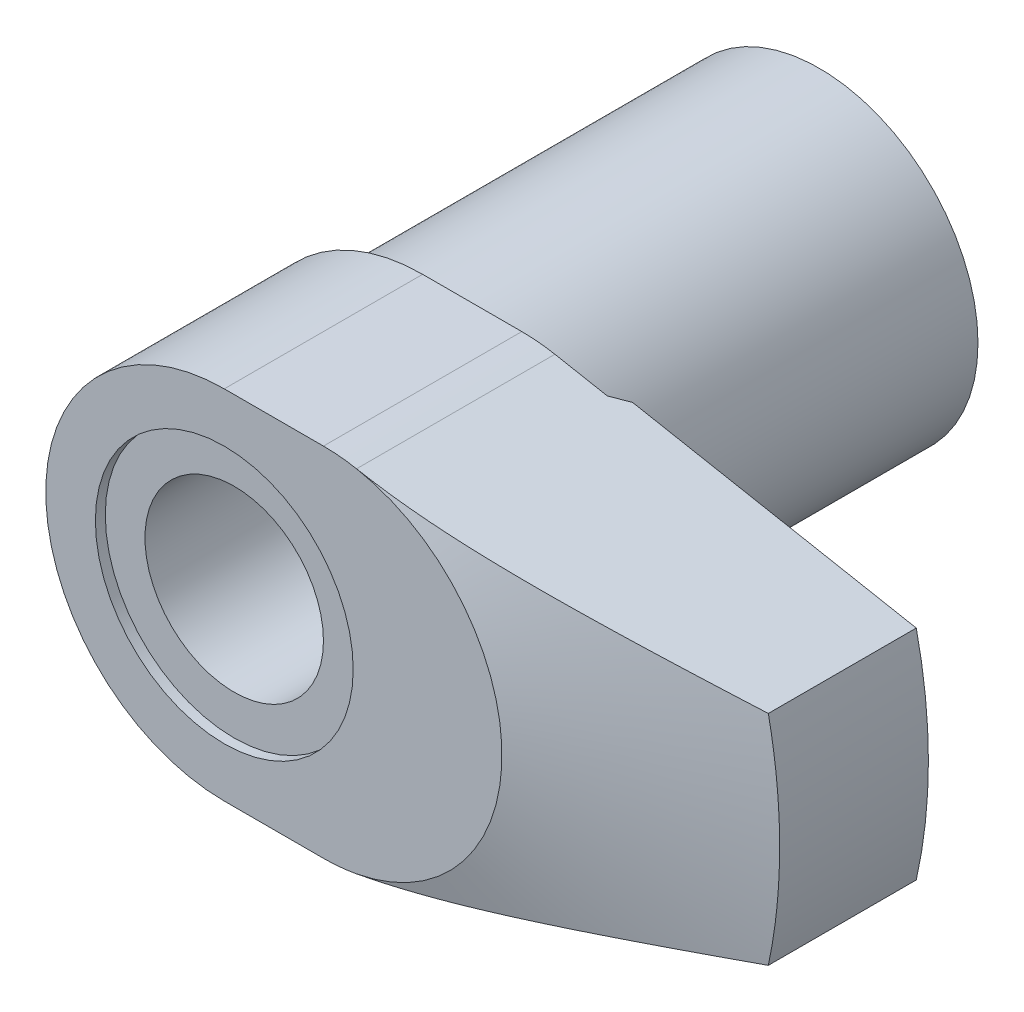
ISO-10303-21;
HEADER;
FILE_DESCRIPTION(('STEP AP214'),'2;1');
FILE_NAME('part.step','',(''),(''),'','','');
FILE_SCHEMA(('AUTOMOTIVE_DESIGN { 1 0 10303 214 1 1 1 1 }'));
ENDSEC;
DATA;
#1=APPLICATION_CONTEXT('core data for automotive mechanical design processes');
#2=APPLICATION_PROTOCOL_DEFINITION('international standard','automotive_design',2000,#1);
#3=PRODUCT_CONTEXT('',#1,'mechanical');
#4=PRODUCT('Part','Part','',(#3));
#5=PRODUCT_RELATED_PRODUCT_CATEGORY('part','',(#4));
#6=PRODUCT_DEFINITION_FORMATION('','',#4);
#7=PRODUCT_DEFINITION_CONTEXT('part definition',#1,'design');
#8=PRODUCT_DEFINITION('design','',#6,#7);
#9=PRODUCT_DEFINITION_SHAPE('','',#8);
#10=(LENGTH_UNIT() NAMED_UNIT(*) SI_UNIT(.MILLI.,.METRE.));
#11=(NAMED_UNIT(*) PLANE_ANGLE_UNIT() SI_UNIT($,.RADIAN.));
#12=(NAMED_UNIT(*) SI_UNIT($,.STERADIAN.) SOLID_ANGLE_UNIT());
#13=UNCERTAINTY_MEASURE_WITH_UNIT(LENGTH_MEASURE(1.E-05),#10,'distance_accuracy_value','');
#14=(GEOMETRIC_REPRESENTATION_CONTEXT(3) GLOBAL_UNCERTAINTY_ASSIGNED_CONTEXT((#13)) GLOBAL_UNIT_ASSIGNED_CONTEXT((#10,
#11,#12)) REPRESENTATION_CONTEXT('',''));
#15=CARTESIAN_POINT('',(0.,0.,0.));
#16=DIRECTION('',(0.,0.,1.));
#17=DIRECTION('',(1.,0.,0.));
#18=AXIS2_PLACEMENT_3D('',#15,#16,#17);
#19=CARTESIAN_POINT('',(48.7749935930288,11.,39.));
#20=DIRECTION('',(0.185449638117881,0.982653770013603,0.));
#21=DIRECTION('',(-0.982653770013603,0.185449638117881,0.));
#22=AXIS2_PLACEMENT_3D('',#19,#20,#21);
#23=PLANE('',#22);
#24=DIRECTION('',(0.,0.,1.));
#25=VECTOR('',#24,1.);
#26=CARTESIAN_POINT('',(13.3380934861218,17.6877678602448,39.));
#27=LINE('',#26,#25);
#28=CARTESIAN_POINT('',(13.3380934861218,17.6877678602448,40.));
#29=VERTEX_POINT('',#28);
#30=CARTESIAN_POINT('',(13.3380934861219,17.6877678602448,60.));
#31=VERTEX_POINT('',#30);
#32=EDGE_CURVE('E117',#29,#31,#27,.T.);
#33=ORIENTED_EDGE('',*,*,#32,.T.);
#34=CARTESIAN_POINT('',(13.3378934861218,17.6878056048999,59.9999999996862));
#35=CARTESIAN_POINT('',(13.7171760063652,17.6162261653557,60.0000170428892));
#36=CARTESIAN_POINT('',(14.0964563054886,17.5446471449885,59.9966168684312));
#37=CARTESIAN_POINT('',(14.8548924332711,17.401512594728,59.9830983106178));
#38=CARTESIAN_POINT('',(15.2340482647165,17.3299570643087,59.9729800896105));
#39=CARTESIAN_POINT('',(15.9920234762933,17.1869094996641,59.9461455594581));
#40=CARTESIAN_POINT('',(16.3708429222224,17.1154174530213,59.9294311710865));
#41=CARTESIAN_POINT('',(17.1281561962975,16.9724948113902,59.8896272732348));
#42=CARTESIAN_POINT('',(17.5066500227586,16.9010642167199,59.8665377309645));
#43=CARTESIAN_POINT('',(18.6401621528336,16.6871440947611,59.7882077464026));
#44=CARTESIAN_POINT('',(19.3945854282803,16.5447668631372,59.7238553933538));
#45=CARTESIAN_POINT('',(20.9013719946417,16.2604011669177,59.5736091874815));
#46=CARTESIAN_POINT('',(21.6537351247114,16.1184127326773,59.4877136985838));
#47=CARTESIAN_POINT('',(23.1538953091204,15.8352975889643,59.2977882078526));
#48=CARTESIAN_POINT('',(23.9016992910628,15.6941695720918,59.1938143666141));
#49=CARTESIAN_POINT('',(25.3950618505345,15.4123372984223,58.9705329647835));
#50=CARTESIAN_POINT('',(26.1406204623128,15.2716330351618,58.8512256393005));
#51=CARTESIAN_POINT('',(27.6300337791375,14.9905460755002,58.5998747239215));
#52=CARTESIAN_POINT('',(28.3738874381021,14.8501635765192,58.4678247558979));
#53=CARTESIAN_POINT('',(29.8597278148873,14.5697509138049,58.1933062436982));
#54=CARTESIAN_POINT('',(30.601714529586,14.4297207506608,58.0508376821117));
#55=CARTESIAN_POINT('',(32.0727292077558,14.1521060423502,57.7595953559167));
#56=CARTESIAN_POINT('',(32.8017820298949,14.0145168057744,57.6109511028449));
#57=CARTESIAN_POINT('',(34.2585048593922,13.7395993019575,57.3068302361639));
#58=CARTESIAN_POINT('',(34.9861748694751,13.6022710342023,57.1513536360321));
#59=CARTESIAN_POINT('',(36.4401757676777,13.327867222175,56.8347765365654));
#60=CARTESIAN_POINT('',(37.1665068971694,13.1907916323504,56.6736771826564));
#61=CARTESIAN_POINT('',(38.6181463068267,12.9168334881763,56.3467724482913));
#62=CARTESIAN_POINT('',(39.3434545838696,12.7799509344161,56.1809670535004));
#63=CARTESIAN_POINT('',(40.7953350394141,12.5059472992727,55.844920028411));
#64=CARTESIAN_POINT('',(41.5219046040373,12.3688267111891,55.674666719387));
#65=CARTESIAN_POINT('',(42.9742806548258,12.0947295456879,55.3308212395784));
#66=CARTESIAN_POINT('',(43.7000871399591,11.957752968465,55.1572290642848));
#67=CARTESIAN_POINT('',(45.1511071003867,11.6839117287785,54.807202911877));
#68=CARTESIAN_POINT('',(45.876320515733,11.5470470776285,54.6307686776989));
#69=CARTESIAN_POINT('',(47.3261685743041,11.2734270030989,54.2754753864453));
#70=CARTESIAN_POINT('',(48.0508032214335,11.1366715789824,54.0966163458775));
#71=CARTESIAN_POINT('',(48.7751935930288,10.9999622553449,53.9167444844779));
#72=B_SPLINE_CURVE_WITH_KNOTS('',3,(#34,#35,#36,#37,#38,#39,#40,#41,#42,#43,#44,#45,#46,#47,#48,
#49,#50,#51,#52,#53,#54,#55,#56,#57,#58,#59,#60,#61,#62,#63,#64,#65,#66,#67,#68,#69,#70,#71),
.UNSPECIFIED.,.F.,.F.,(4,2,2,2,2,2,2,2,2,2,2,2,2,2,2,2,2,2,4),(0.,1.15791456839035,
2.31580115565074,3.47335082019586,4.63090643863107,6.94182118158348,9.25291147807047,
11.5569465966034,13.8609463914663,16.1661054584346,18.4712683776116,20.7412290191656,
23.0111851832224,25.280681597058,27.5501849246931,29.8264061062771,32.1026303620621,
34.3790616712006,36.6554774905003),.UNSPECIFIED.);
#73=CARTESIAN_POINT('',(48.7749935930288,11.,53.9167941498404));
#74=VERTEX_POINT('',#73);
#75=EDGE_CURVE('E95',#31,#74,#72,.T.);
#76=ORIENTED_EDGE('',*,*,#75,.T.);
#77=DIRECTION('',(0.,0.,1.));
#78=VECTOR('',#77,1.);
#79=CARTESIAN_POINT('',(48.7749935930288,11.,39.));
#80=LINE('',#79,#78);
#81=CARTESIAN_POINT('',(48.7749935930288,11.,39.));
#82=VERTEX_POINT('',#81);
#83=EDGE_CURVE('E123',#82,#74,#80,.T.);
#84=ORIENTED_EDGE('',*,*,#83,.F.);
#85=DIRECTION('',(-0.982653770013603,0.185449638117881,0.));
#86=VECTOR('',#85,1.);
#87=CARTESIAN_POINT('',(48.7749935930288,11.,39.));
#88=LINE('',#87,#86);
#89=CARTESIAN_POINT('',(20.1776893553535,16.3969769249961,39.));
#90=VERTEX_POINT('',#89);
#91=EDGE_CURVE('E153',#82,#90,#88,.T.);
#92=ORIENTED_EDGE('',*,*,#91,.T.);
#93=CARTESIAN_POINT('',(18.6102300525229,16.692792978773,40.0002));
#94=CARTESIAN_POINT('',(18.742019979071,16.6679211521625,39.9187004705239));
#95=CARTESIAN_POINT('',(18.873513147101,16.6431053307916,39.8367046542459));
#96=CARTESIAN_POINT('',(19.135917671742,16.5935834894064,39.6717681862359));
#97=CARTESIAN_POINT('',(19.266829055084,16.5688774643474,39.588827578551));
#98=CARTESIAN_POINT('',(19.5280935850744,16.5195707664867,39.4220419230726));
#99=CARTESIAN_POINT('',(19.658446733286,16.4949700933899,39.338196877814));
#100=CARTESIAN_POINT('',(19.9186184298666,16.4458696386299,39.1696385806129));
#101=CARTESIAN_POINT('',(20.0484369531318,16.4213698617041,39.0849252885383));
#102=CARTESIAN_POINT('',(20.1779937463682,16.3969194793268,38.9998));
#103=B_SPLINE_CURVE_WITH_KNOTS('',3,(#93,#94,#95,#96,#97,#98,#99,#100,#101,#102),.UNSPECIFIED.,
.F.,.F.,(4,2,2,2,4),(0.,0.470810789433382,0.94159971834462,1.41238732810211,1.88319679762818),.UNSPECIFIED.);
#104=CARTESIAN_POINT('',(18.6105534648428,16.6927319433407,40.));
#105=VERTEX_POINT('',#104);
#106=EDGE_CURVE('E188',#105,#90,#103,.T.);
#107=ORIENTED_EDGE('',*,*,#106,.F.);
#108=DIRECTION('',(0.982653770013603,-0.185449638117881,0.));
#109=VECTOR('',#108,1.);
#110=CARTESIAN_POINT('',(13.3380934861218,17.6877678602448,40.));
#111=LINE('',#110,#109);
#112=EDGE_CURVE('E119',#29,#105,#111,.T.);
#113=ORIENTED_EDGE('',*,*,#112,.F.);
#114=EDGE_LOOP('',(#33,#76,#84,#92,#107,#113));
#115=FACE_BOUND('',#114,.T.);
#116=ADVANCED_FACE('F14',(#115),#23,.T.);
#117=CARTESIAN_POINT('',(48.7749935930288,-11.,39.));
#118=DIRECTION('',(0.185449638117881,-0.982653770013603,0.));
#119=DIRECTION('',(0.982653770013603,0.185449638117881,0.));
#120=AXIS2_PLACEMENT_3D('',#117,#118,#119);
#121=PLANE('',#120);
#122=DIRECTION('',(0.,0.,1.));
#123=VECTOR('',#122,1.);
#124=CARTESIAN_POINT('',(48.7749935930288,-11.,39.));
#125=LINE('',#124,#123);
#126=CARTESIAN_POINT('',(48.7749935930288,-11.,39.));
#127=VERTEX_POINT('',#126);
#128=CARTESIAN_POINT('',(48.7749935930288,-11.,53.9167941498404));
#129=VERTEX_POINT('',#128);
#130=EDGE_CURVE('E147',#127,#129,#125,.T.);
#131=ORIENTED_EDGE('',*,*,#130,.T.);
#132=CARTESIAN_POINT('',(48.7751935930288,-10.9999622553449,53.9167444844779));
#133=CARTESIAN_POINT('',(48.0465361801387,-11.1374768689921,54.0976756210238));
#134=CARTESIAN_POINT('',(47.3176316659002,-11.2750381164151,54.2775823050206));
#135=CARTESIAN_POINT('',(45.8592364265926,-11.5502712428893,54.6349399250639));
#136=CARTESIAN_POINT('',(45.1297456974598,-11.6879431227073,54.8123908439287));
#137=CARTESIAN_POINT('',(43.670157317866,-11.9634014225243,55.1644128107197));
#138=CARTESIAN_POINT('',(42.9400597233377,-12.1011878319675,55.3389840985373));
#139=CARTESIAN_POINT('',(41.4790904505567,-12.3769067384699,55.6847383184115));
#140=CARTESIAN_POINT('',(40.7482187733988,-12.5148392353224,55.855921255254));
#141=CARTESIAN_POINT('',(39.2877585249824,-12.7904620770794,56.1937556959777));
#142=CARTESIAN_POINT('',(38.5581726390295,-12.9281519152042,56.3604192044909));
#143=CARTESIAN_POINT('',(37.0979614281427,-13.2037277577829,56.6889595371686));
#144=CARTESIAN_POINT('',(36.3673361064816,-13.3416137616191,56.8508363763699));
#145=CARTESIAN_POINT('',(34.9047280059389,-13.6176419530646,57.1688639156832));
#146=CARTESIAN_POINT('',(34.1727449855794,-13.7557841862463,57.3250134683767));
#147=CARTESIAN_POINT('',(32.70737170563,-14.0323342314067,57.630345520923));
#148=CARTESIAN_POINT('',(31.9739814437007,-14.1707420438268,57.7795280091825));
#149=CARTESIAN_POINT('',(30.5028244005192,-14.4483836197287,58.0699756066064));
#150=CARTESIAN_POINT('',(29.7650515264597,-14.5876185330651,58.2112088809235));
#151=CARTESIAN_POINT('',(28.2876513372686,-14.8664383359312,58.4832933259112));
#152=CARTESIAN_POINT('',(27.5480240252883,-15.0060232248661,58.6141445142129));
#153=CARTESIAN_POINT('',(26.0670755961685,-15.2855126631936,58.863159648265));
#154=CARTESIAN_POINT('',(25.3257555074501,-15.4254170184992,58.9813298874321));
#155=CARTESIAN_POINT('',(23.8408933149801,-15.7056450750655,59.2024316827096));
#156=CARTESIAN_POINT('',(23.0973511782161,-15.8459687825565,59.3053630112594));
#157=CARTESIAN_POINT('',(21.6057597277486,-16.1274668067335,59.4933400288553));
#158=CARTESIAN_POINT('',(20.8577035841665,-16.2686424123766,59.5783300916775));
#159=CARTESIAN_POINT('',(19.3595596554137,-16.551377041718,59.7269620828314));
#160=CARTESIAN_POINT('',(18.6094720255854,-16.6929360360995,59.7906055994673));
#161=CARTESIAN_POINT('',(17.4824925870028,-16.9056232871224,59.8680607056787));
#162=CARTESIAN_POINT('',(17.1061863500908,-16.9766410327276,59.8908897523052));
#163=CARTESIAN_POINT('',(16.3532535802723,-17.1187369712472,59.9302421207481));
#164=CARTESIAN_POINT('',(15.9766270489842,-17.1898151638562,59.9467654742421));
#165=CARTESIAN_POINT('',(15.223044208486,-17.3320337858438,59.9732922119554));
#166=CARTESIAN_POINT('',(14.8460878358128,-17.4031742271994,59.9832937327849));
#167=CARTESIAN_POINT('',(14.0920528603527,-17.5454781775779,59.9966560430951));
#168=CARTESIAN_POINT('',(13.7149742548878,-17.6166416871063,60.0000166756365));
#169=CARTESIAN_POINT('',(13.3378934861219,-17.6878056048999,59.9999999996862));
#170=B_SPLINE_CURVE_WITH_KNOTS('',3,(#132,#133,#134,#135,#136,#137,#138,#139,#140,#141,#142,
#143,#144,#145,#146,#147,#148,#149,#150,#151,#152,#153,#154,#155,#156,#157,#158,#159,#160,#161,
#162,#163,#164,#165,#166,#167,#168,#169),.UNSPECIFIED.,.F.,.F.,(4,2,2,2,2,2,2,2,2,2,2,2,2,2,2,2,
2,2,4),(0.,2.28982495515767,4.57966592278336,6.86931515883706,9.15896116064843,11.4417702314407,
13.7245721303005,16.0078289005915,18.2910894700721,20.5829240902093,22.874754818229,
25.165442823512,27.456165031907,29.7538884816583,32.0514409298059,33.2022839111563,
34.3531211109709,35.5042869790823,36.6554800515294),.UNSPECIFIED.);
#171=CARTESIAN_POINT('',(13.3380934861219,-17.6877678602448,60.));
#172=VERTEX_POINT('',#171);
#173=EDGE_CURVE('E35',#129,#172,#170,.T.);
#174=ORIENTED_EDGE('',*,*,#173,.T.);
#175=DIRECTION('',(0.,0.,1.));
#176=VECTOR('',#175,1.);
#177=CARTESIAN_POINT('',(13.3380934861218,-17.6877678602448,39.));
#178=LINE('',#177,#176);
#179=CARTESIAN_POINT('',(13.3380934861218,-17.6877678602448,40.));
#180=VERTEX_POINT('',#179);
#181=EDGE_CURVE('E150',#180,#172,#178,.T.);
#182=ORIENTED_EDGE('',*,*,#181,.F.);
#183=DIRECTION('',(-0.982653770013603,-0.185449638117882,0.));
#184=VECTOR('',#183,1.);
#185=CARTESIAN_POINT('',(18.6105534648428,-16.6927319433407,40.));
#186=LINE('',#185,#184);
#187=CARTESIAN_POINT('',(18.6105534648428,-16.6927319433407,40.));
#188=VERTEX_POINT('',#187);
#189=EDGE_CURVE('E219',#188,#180,#186,.T.);
#190=ORIENTED_EDGE('',*,*,#189,.F.);
#191=CARTESIAN_POINT('',(20.1779937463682,-16.3969194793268,38.9998));
#192=CARTESIAN_POINT('',(20.0484369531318,-16.4213698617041,39.0849252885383));
#193=CARTESIAN_POINT('',(19.9186184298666,-16.4458696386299,39.1696385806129));
#194=CARTESIAN_POINT('',(19.658446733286,-16.4949700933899,39.338196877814));
#195=CARTESIAN_POINT('',(19.5280935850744,-16.5195707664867,39.4220419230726));
#196=CARTESIAN_POINT('',(19.266829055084,-16.5688774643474,39.588827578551));
#197=CARTESIAN_POINT('',(19.135917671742,-16.5935834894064,39.6717681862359));
#198=CARTESIAN_POINT('',(18.873513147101,-16.6431053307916,39.8367046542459));
#199=CARTESIAN_POINT('',(18.742019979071,-16.6679211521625,39.9187004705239));
#200=CARTESIAN_POINT('',(18.6102300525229,-16.692792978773,40.0002));
#201=B_SPLINE_CURVE_WITH_KNOTS('',3,(#191,#192,#193,#194,#195,#196,#197,#198,#199,#200),
.UNSPECIFIED.,.F.,.F.,(4,2,2,2,4),(0.,0.470809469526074,0.941597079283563,1.4123860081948,
1.88319679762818),.UNSPECIFIED.);
#202=CARTESIAN_POINT('',(20.1776893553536,-16.3969769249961,39.));
#203=VERTEX_POINT('',#202);
#204=EDGE_CURVE('E28',#203,#188,#201,.T.);
#205=ORIENTED_EDGE('',*,*,#204,.F.);
#206=DIRECTION('',(0.982653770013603,0.185449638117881,0.));
#207=VECTOR('',#206,1.);
#208=CARTESIAN_POINT('',(48.7749935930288,-11.,39.));
#209=LINE('',#208,#207);
#210=EDGE_CURVE('E137',#203,#127,#209,.T.);
#211=ORIENTED_EDGE('',*,*,#210,.T.);
#212=EDGE_LOOP('',(#131,#174,#182,#190,#205,#211));
#213=FACE_BOUND('',#212,.T.);
#214=ADVANCED_FACE('F176',(#213),#121,.T.);
#215=CARTESIAN_POINT('',(0.,0.,60.));
#216=DIRECTION('',(0.,0.,1.));
#217=DIRECTION('',(1.,0.,0.));
#218=AXIS2_PLACEMENT_3D('',#215,#216,#217);
#219=PLANE('',#218);
#220=CARTESIAN_POINT('',(0.,0.,60.));
#221=DIRECTION('',(0.,0.,1.));
#222=DIRECTION('',(1.,0.,0.));
#223=AXIS2_PLACEMENT_3D('',#220,#221,#222);
#224=CIRCLE('',#223,13.);
#225=CARTESIAN_POINT('',(13.,0.,60.));
#226=VERTEX_POINT('',#225);
#227=EDGE_CURVE('E140',#226,#226,#224,.T.);
#228=ORIENTED_EDGE('',*,*,#227,.F.);
#229=EDGE_LOOP('',(#228));
#230=FACE_BOUND('',#229,.T.);
#231=CARTESIAN_POINT('',(10.,0.,60.));
#232=DIRECTION('',(0.,0.,1.));
#233=DIRECTION('',(1.,0.,0.));
#234=AXIS2_PLACEMENT_3D('',#231,#232,#233);
#235=CIRCLE('',#234,18.);
#236=CARTESIAN_POINT('',(10.,-18.,60.));
#237=VERTEX_POINT('',#236);
#238=EDGE_CURVE('E113',#237,#172,#235,.T.);
#239=ORIENTED_EDGE('',*,*,#238,.T.);
#240=CARTESIAN_POINT('',(10.,0.,60.));
#241=DIRECTION('',(0.,0.,-1.));
#242=DIRECTION('',(-1.,0.,0.));
#243=AXIS2_PLACEMENT_3D('',#240,#241,#242);
#244=CIRCLE('',#243,18.);
#245=EDGE_CURVE('E98',#31,#172,#244,.T.);
#246=ORIENTED_EDGE('',*,*,#245,.F.);
#247=CARTESIAN_POINT('',(10.,0.,60.));
#248=DIRECTION('',(0.,0.,1.));
#249=DIRECTION('',(1.,0.,0.));
#250=AXIS2_PLACEMENT_3D('',#247,#248,#249);
#251=CIRCLE('',#250,18.);
#252=CARTESIAN_POINT('',(10.,18.,60.));
#253=VERTEX_POINT('',#252);
#254=EDGE_CURVE('E110',#31,#253,#251,.T.);
#255=ORIENTED_EDGE('',*,*,#254,.T.);
#256=DIRECTION('',(-1.,0.,0.));
#257=VECTOR('',#256,1.);
#258=CARTESIAN_POINT('',(10.,18.,60.));
#259=LINE('',#258,#257);
#260=CARTESIAN_POINT('',(0.,18.,60.));
#261=VERTEX_POINT('',#260);
#262=EDGE_CURVE('E128',#253,#261,#259,.T.);
#263=ORIENTED_EDGE('',*,*,#262,.T.);
#264=CARTESIAN_POINT('',(0.,0.,60.));
#265=DIRECTION('',(0.,0.,1.));
#266=DIRECTION('',(1.,0.,0.));
#267=AXIS2_PLACEMENT_3D('',#264,#265,#266);
#268=CIRCLE('',#267,18.);
#269=CARTESIAN_POINT('',(0.,-18.,60.));
#270=VERTEX_POINT('',#269);
#271=EDGE_CURVE('E166',#261,#270,#268,.T.);
#272=ORIENTED_EDGE('',*,*,#271,.T.);
#273=DIRECTION('',(1.,0.,0.));
#274=VECTOR('',#273,1.);
#275=CARTESIAN_POINT('',(1.88540101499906E-13,-18.,60.));
#276=LINE('',#275,#274);
#277=EDGE_CURVE('E130',#270,#237,#276,.T.);
#278=ORIENTED_EDGE('',*,*,#277,.T.);
#279=EDGE_LOOP('',(#239,#246,#255,#263,#272,#278));
#280=FACE_BOUND('',#279,.T.);
#281=ADVANCED_FACE('F107',(#230,#280),#219,.T.);
#282=CARTESIAN_POINT('',(0.,0.,39.));
#283=DIRECTION('',(0.,0.,1.));
#284=DIRECTION('',(1.,0.,0.));
#285=AXIS2_PLACEMENT_3D('',#282,#283,#284);
#286=CYLINDRICAL_SURFACE('',#285,50.);
#287=ORIENTED_EDGE('',*,*,#83,.T.);
#288=CARTESIAN_POINT('',(48.7749484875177,11.0002,53.9167910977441));
#289=CARTESIAN_POINT('',(48.9306309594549,10.3099440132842,53.9273259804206));
#290=CARTESIAN_POINT('',(49.0716452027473,9.61637074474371,53.9368824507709));
#291=CARTESIAN_POINT('',(49.324122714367,8.22383261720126,53.9540108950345));
#292=CARTESIAN_POINT('',(49.4355856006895,7.52486768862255,53.9615828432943));
#293=CARTESIAN_POINT('',(49.62878932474,6.12246248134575,53.9747175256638));
#294=CARTESIAN_POINT('',(49.7105155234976,5.41902017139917,53.9802792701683));
#295=CARTESIAN_POINT('',(49.8440224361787,4.00933979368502,53.9893694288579));
#296=CARTESIAN_POINT('',(49.8958036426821,3.3031017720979,53.9928978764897));
#297=CARTESIAN_POINT('',(50.0047161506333,1.20802801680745,54.0003201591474));
#298=CARTESIAN_POINT('',(50.0189880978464,-0.18326917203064,54.0012942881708));
#299=CARTESIAN_POINT('',(49.9315541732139,-2.96142486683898,53.9953338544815));
#300=CARTESIAN_POINT('',(49.8299183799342,-4.34828554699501,53.9884040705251));
#301=CARTESIAN_POINT('',(49.6198783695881,-6.16973049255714,53.9741128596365));
#302=CARTESIAN_POINT('',(49.5630560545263,-6.61068793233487,53.9702481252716));
#303=CARTESIAN_POINT('',(49.4376820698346,-7.49086697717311,53.9617264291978));
#304=CARTESIAN_POINT('',(49.3691325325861,-7.93008888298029,53.9570696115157));
#305=CARTESIAN_POINT('',(49.2199027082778,-8.80915057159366,53.9469394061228));
#306=CARTESIAN_POINT('',(49.1391524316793,-9.24897838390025,53.9414613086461));
#307=CARTESIAN_POINT('',(48.9658705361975,-10.1263788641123,53.9297160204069));
#308=CARTESIAN_POINT('',(48.8733367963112,-10.5639511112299,53.9234486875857));
#309=CARTESIAN_POINT('',(48.7749484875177,-11.0002,53.9167910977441));
#310=B_SPLINE_CURVE_WITH_KNOTS('',3,(#288,#289,#290,#291,#292,#293,#294,#295,#296,#297,#298,
#299,#300,#301,#302,#303,#304,#305,#306,#307,#308,#309),.UNSPECIFIED.,.F.,.F.,(4,2,2,2,2,2,2,2,
2,2,4),(0.,2.12284835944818,4.24572415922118,6.36964361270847,8.49352812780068,12.6625156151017,
16.828983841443,18.1627427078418,19.4962593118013,20.837738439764,22.1794593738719),.UNSPECIFIED.);
#311=EDGE_CURVE('E9',#74,#129,#310,.T.);
#312=ORIENTED_EDGE('',*,*,#311,.T.);
#313=ORIENTED_EDGE('',*,*,#130,.F.);
#314=CARTESIAN_POINT('',(0.,0.,39.));
#315=DIRECTION('',(0.,0.,1.));
#316=DIRECTION('',(1.,0.,0.));
#317=AXIS2_PLACEMENT_3D('',#314,#315,#316);
#318=CIRCLE('',#317,50.);
#319=EDGE_CURVE('E235',#127,#82,#318,.T.);
#320=ORIENTED_EDGE('',*,*,#319,.T.);
#321=EDGE_LOOP('',(#287,#312,#313,#320));
#322=FACE_BOUND('',#321,.T.);
#323=ADVANCED_FACE('F204',(#322),#286,.T.);
#324=CARTESIAN_POINT('',(10.,0.,39.));
#325=DIRECTION('',(0.,0.,1.));
#326=DIRECTION('',(1.,0.,0.));
#327=AXIS2_PLACEMENT_3D('',#324,#325,#326);
#328=CYLINDRICAL_SURFACE('',#327,18.);
#329=DIRECTION('',(0.,0.,1.));
#330=VECTOR('',#329,1.);
#331=CARTESIAN_POINT('',(10.,-18.,39.));
#332=LINE('',#331,#330);
#333=CARTESIAN_POINT('',(10.,-18.,40.));
#334=VERTEX_POINT('',#333);
#335=EDGE_CURVE('E138',#334,#237,#332,.T.);
#336=ORIENTED_EDGE('',*,*,#335,.F.);
#337=CARTESIAN_POINT('',(10.,0.,40.));
#338=DIRECTION('',(0.,0.,-1.));
#339=DIRECTION('',(-1.,0.,0.));
#340=AXIS2_PLACEMENT_3D('',#337,#338,#339);
#341=CIRCLE('',#340,18.);
#342=EDGE_CURVE('E221',#180,#334,#341,.T.);
#343=ORIENTED_EDGE('',*,*,#342,.F.);
#344=ORIENTED_EDGE('',*,*,#181,.T.);
#345=ORIENTED_EDGE('',*,*,#238,.F.);
#346=EDGE_LOOP('',(#336,#343,#344,#345));
#347=FACE_BOUND('',#346,.T.);
#348=ADVANCED_FACE('F273',(#347),#328,.T.);
#349=CARTESIAN_POINT('',(1.88540101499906E-13,-18.,39.));
#350=DIRECTION('',(0.,-1.,0.));
#351=DIRECTION('',(1.,0.,0.));
#352=AXIS2_PLACEMENT_3D('',#349,#350,#351);
#353=PLANE('',#352);
#354=DIRECTION('',(0.,0.,1.));
#355=VECTOR('',#354,1.);
#356=CARTESIAN_POINT('',(1.88540101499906E-13,-18.,39.));
#357=LINE('',#356,#355);
#358=CARTESIAN_POINT('',(0.,-18.,40.));
#359=VERTEX_POINT('',#358);
#360=EDGE_CURVE('E141',#359,#270,#357,.T.);
#361=ORIENTED_EDGE('',*,*,#360,.F.);
#362=DIRECTION('',(-1.,0.,0.));
#363=VECTOR('',#362,1.);
#364=CARTESIAN_POINT('',(10.,-18.,40.));
#365=LINE('',#364,#363);
#366=EDGE_CURVE('E223',#334,#359,#365,.T.);
#367=ORIENTED_EDGE('',*,*,#366,.F.);
#368=ORIENTED_EDGE('',*,*,#335,.T.);
#369=ORIENTED_EDGE('',*,*,#277,.F.);
#370=EDGE_LOOP('',(#361,#367,#368,#369));
#371=FACE_BOUND('',#370,.T.);
#372=ADVANCED_FACE('F250',(#371),#353,.T.);
#373=CARTESIAN_POINT('',(10.,18.,39.));
#374=DIRECTION('',(0.,1.,0.));
#375=DIRECTION('',(-1.,0.,0.));
#376=AXIS2_PLACEMENT_3D('',#373,#374,#375);
#377=PLANE('',#376);
#378=DIRECTION('',(0.,0.,1.));
#379=VECTOR('',#378,1.);
#380=CARTESIAN_POINT('',(10.,18.,39.));
#381=LINE('',#380,#379);
#382=CARTESIAN_POINT('',(10.,18.,40.));
#383=VERTEX_POINT('',#382);
#384=EDGE_CURVE('E122',#383,#253,#381,.T.);
#385=ORIENTED_EDGE('',*,*,#384,.F.);
#386=DIRECTION('',(1.,0.,0.));
#387=VECTOR('',#386,1.);
#388=CARTESIAN_POINT('',(0.,18.,40.));
#389=LINE('',#388,#387);
#390=CARTESIAN_POINT('',(0.,18.,40.));
#391=VERTEX_POINT('',#390);
#392=EDGE_CURVE('E225',#391,#383,#389,.T.);
#393=ORIENTED_EDGE('',*,*,#392,.F.);
#394=DIRECTION('',(0.,0.,1.));
#395=VECTOR('',#394,1.);
#396=CARTESIAN_POINT('',(0.,18.,39.));
#397=LINE('',#396,#395);
#398=EDGE_CURVE('E143',#391,#261,#397,.T.);
#399=ORIENTED_EDGE('',*,*,#398,.T.);
#400=ORIENTED_EDGE('',*,*,#262,.F.);
#401=EDGE_LOOP('',(#385,#393,#399,#400));
#402=FACE_BOUND('',#401,.T.);
#403=ADVANCED_FACE('F253',(#402),#377,.T.);
#404=CARTESIAN_POINT('',(10.,0.,39.));
#405=DIRECTION('',(0.,0.,1.));
#406=DIRECTION('',(1.,0.,0.));
#407=AXIS2_PLACEMENT_3D('',#404,#405,#406);
#408=CYLINDRICAL_SURFACE('',#407,18.);
#409=ORIENTED_EDGE('',*,*,#32,.F.);
#410=CARTESIAN_POINT('',(10.,0.,40.));
#411=DIRECTION('',(0.,0.,-1.));
#412=DIRECTION('',(-1.,0.,0.));
#413=AXIS2_PLACEMENT_3D('',#410,#411,#412);
#414=CIRCLE('',#413,18.);
#415=EDGE_CURVE('E102',#383,#29,#414,.T.);
#416=ORIENTED_EDGE('',*,*,#415,.F.);
#417=ORIENTED_EDGE('',*,*,#384,.T.);
#418=ORIENTED_EDGE('',*,*,#254,.F.);
#419=EDGE_LOOP('',(#409,#416,#417,#418));
#420=FACE_BOUND('',#419,.T.);
#421=ADVANCED_FACE('F125',(#420),#408,.T.);
#422=CARTESIAN_POINT('',(0.,0.,60.));
#423=DIRECTION('',(0.,0.,-1.));
#424=DIRECTION('',(-1.,0.,0.));
#425=AXIS2_PLACEMENT_3D('',#422,#423,#424);
#426=CYLINDRICAL_SURFACE('',#425,18.);
#427=CARTESIAN_POINT('',(0.,0.,40.));
#428=DIRECTION('',(0.,0.,1.));
#429=DIRECTION('',(1.,0.,0.));
#430=AXIS2_PLACEMENT_3D('',#427,#428,#429);
#431=CIRCLE('',#430,18.);
#432=EDGE_CURVE('E196',#391,#359,#431,.T.);
#433=ORIENTED_EDGE('',*,*,#432,.T.);
#434=ORIENTED_EDGE('',*,*,#360,.T.);
#435=ORIENTED_EDGE('',*,*,#271,.F.);
#436=ORIENTED_EDGE('',*,*,#398,.F.);
#437=EDGE_LOOP('',(#433,#434,#435,#436));
#438=FACE_BOUND('',#437,.T.);
#439=ADVANCED_FACE('F16',(#438),#426,.T.);
#440=CARTESIAN_POINT('',(60.,20.,39.));
#441=DIRECTION('',(0.,0.,1.));
#442=DIRECTION('',(1.,0.,0.));
#443=AXIS2_PLACEMENT_3D('',#440,#441,#442);
#444=PLANE('',#443);
#445=ORIENTED_EDGE('',*,*,#210,.F.);
#446=CARTESIAN_POINT('',(0.,0.,39.));
#447=DIRECTION('',(0.,0.,1.));
#448=DIRECTION('',(1.,0.,0.));
#449=AXIS2_PLACEMENT_3D('',#446,#447,#448);
#450=CIRCLE('',#449,26.);
#451=EDGE_CURVE('E42',#203,#90,#450,.T.);
#452=ORIENTED_EDGE('',*,*,#451,.T.);
#453=ORIENTED_EDGE('',*,*,#91,.F.);
#454=ORIENTED_EDGE('',*,*,#319,.F.);
#455=EDGE_LOOP('',(#445,#452,#453,#454));
#456=FACE_BOUND('',#455,.T.);
#457=ADVANCED_FACE('F279',(#456),#444,.F.);
#458=CARTESIAN_POINT('',(0.,0.,60.));
#459=DIRECTION('',(0.,0.,-1.));
#460=DIRECTION('',(-1.,0.,0.));
#461=AXIS2_PLACEMENT_3D('',#458,#459,#460);
#462=CYLINDRICAL_SURFACE('',#461,9.);
#463=CARTESIAN_POINT('',(0.,0.,0.));
#464=DIRECTION('',(0.,0.,1.));
#465=DIRECTION('',(1.,0.,0.));
#466=AXIS2_PLACEMENT_3D('',#463,#464,#465);
#467=CIRCLE('',#466,9.);
#468=CARTESIAN_POINT('',(9.,0.,0.));
#469=VERTEX_POINT('',#468);
#470=EDGE_CURVE('E163',#469,#469,#467,.T.);
#471=ORIENTED_EDGE('',*,*,#470,.F.);
#472=EDGE_LOOP('',(#471));
#473=FACE_BOUND('',#472,.T.);
#474=CARTESIAN_POINT('',(0.,0.,59.));
#475=DIRECTION('',(0.,0.,1.));
#476=DIRECTION('',(1.,0.,0.));
#477=AXIS2_PLACEMENT_3D('',#474,#475,#476);
#478=CIRCLE('',#477,9.);
#479=CARTESIAN_POINT('',(9.,0.,59.));
#480=VERTEX_POINT('',#479);
#481=EDGE_CURVE('E157',#480,#480,#478,.T.);
#482=ORIENTED_EDGE('',*,*,#481,.T.);
#483=EDGE_LOOP('',(#482));
#484=FACE_BOUND('',#483,.T.);
#485=ADVANCED_FACE('F282',(#473,#484),#462,.F.);
#486=CARTESIAN_POINT('',(0.,0.,0.));
#487=DIRECTION('',(0.,0.,1.));
#488=DIRECTION('',(1.,0.,0.));
#489=AXIS2_PLACEMENT_3D('',#486,#487,#488);
#490=PLANE('',#489);
#491=ORIENTED_EDGE('',*,*,#470,.T.);
#492=EDGE_LOOP('',(#491));
#493=FACE_BOUND('',#492,.T.);
#494=CARTESIAN_POINT('',(0.,0.,0.));
#495=DIRECTION('',(0.,0.,-1.));
#496=DIRECTION('',(-1.,0.,0.));
#497=AXIS2_PLACEMENT_3D('',#494,#495,#496);
#498=CIRCLE('',#497,16.);
#499=CARTESIAN_POINT('',(-16.,0.,0.));
#500=VERTEX_POINT('',#499);
#501=EDGE_CURVE('E160',#500,#500,#498,.T.);
#502=ORIENTED_EDGE('',*,*,#501,.T.);
#503=EDGE_LOOP('',(#502));
#504=FACE_BOUND('',#503,.T.);
#505=ADVANCED_FACE('F277',(#493,#504),#490,.F.);
#506=CARTESIAN_POINT('',(0.,0.,39.));
#507=DIRECTION('',(0.,0.,-1.));
#508=DIRECTION('',(-1.,0.,0.));
#509=AXIS2_PLACEMENT_3D('',#506,#507,#508);
#510=CYLINDRICAL_SURFACE('',#509,16.);
#511=ORIENTED_EDGE('',*,*,#501,.F.);
#512=EDGE_LOOP('',(#511));
#513=FACE_BOUND('',#512,.T.);
#514=CARTESIAN_POINT('',(0.,0.,40.));
#515=DIRECTION('',(0.,0.,1.));
#516=DIRECTION('',(1.,0.,0.));
#517=AXIS2_PLACEMENT_3D('',#514,#515,#516);
#518=CIRCLE('',#517,16.);
#519=CARTESIAN_POINT('',(16.,0.,40.));
#520=VERTEX_POINT('',#519);
#521=EDGE_CURVE('E132',#520,#520,#518,.T.);
#522=ORIENTED_EDGE('',*,*,#521,.F.);
#523=EDGE_LOOP('',(#522));
#524=FACE_BOUND('',#523,.T.);
#525=ADVANCED_FACE('F268',(#513,#524),#510,.T.);
#526=CARTESIAN_POINT('',(0.,0.,59.));
#527=DIRECTION('',(0.,0.,1.));
#528=DIRECTION('',(1.,0.,0.));
#529=AXIS2_PLACEMENT_3D('',#526,#527,#528);
#530=CYLINDRICAL_SURFACE('',#529,13.);
#531=CARTESIAN_POINT('',(0.,0.,59.));
#532=DIRECTION('',(0.,0.,1.));
#533=DIRECTION('',(1.,0.,0.));
#534=AXIS2_PLACEMENT_3D('',#531,#532,#533);
#535=CIRCLE('',#534,13.);
#536=CARTESIAN_POINT('',(13.,0.,59.));
#537=VERTEX_POINT('',#536);
#538=EDGE_CURVE('E154',#537,#537,#535,.T.);
#539=ORIENTED_EDGE('',*,*,#538,.F.);
#540=EDGE_LOOP('',(#539));
#541=FACE_BOUND('',#540,.T.);
#542=ORIENTED_EDGE('',*,*,#227,.T.);
#543=EDGE_LOOP('',(#542));
#544=FACE_BOUND('',#543,.T.);
#545=ADVANCED_FACE('F261',(#541,#544),#530,.F.);
#546=CARTESIAN_POINT('',(0.,0.,59.));
#547=DIRECTION('',(0.,0.,1.));
#548=DIRECTION('',(1.,0.,0.));
#549=AXIS2_PLACEMENT_3D('',#546,#547,#548);
#550=PLANE('',#549);
#551=ORIENTED_EDGE('',*,*,#481,.F.);
#552=EDGE_LOOP('',(#551));
#553=FACE_BOUND('',#552,.T.);
#554=ORIENTED_EDGE('',*,*,#538,.T.);
#555=EDGE_LOOP('',(#554));
#556=FACE_BOUND('',#555,.T.);
#557=ADVANCED_FACE('F255',(#553,#556),#550,.T.);
#558=CARTESIAN_POINT('',(-16.,0.,40.));
#559=DIRECTION('',(0.,0.,-1.));
#560=DIRECTION('',(-1.,0.,0.));
#561=AXIS2_PLACEMENT_3D('',#558,#559,#560);
#562=PLANE('',#561);
#563=ORIENTED_EDGE('',*,*,#521,.T.);
#564=EDGE_LOOP('',(#563));
#565=FACE_BOUND('',#564,.T.);
#566=ORIENTED_EDGE('',*,*,#432,.F.);
#567=ORIENTED_EDGE('',*,*,#392,.T.);
#568=ORIENTED_EDGE('',*,*,#415,.T.);
#569=ORIENTED_EDGE('',*,*,#112,.T.);
#570=CARTESIAN_POINT('',(0.,0.,40.));
#571=DIRECTION('',(0.,0.,1.));
#572=DIRECTION('',(1.,0.,0.));
#573=AXIS2_PLACEMENT_3D('',#570,#571,#572);
#574=CIRCLE('',#573,25.);
#575=EDGE_CURVE('E197',#188,#105,#574,.T.);
#576=ORIENTED_EDGE('',*,*,#575,.F.);
#577=ORIENTED_EDGE('',*,*,#189,.T.);
#578=ORIENTED_EDGE('',*,*,#342,.T.);
#579=ORIENTED_EDGE('',*,*,#366,.T.);
#580=EDGE_LOOP('',(#566,#567,#568,#569,#576,#577,#578,#579));
#581=FACE_BOUND('',#580,.T.);
#582=ADVANCED_FACE('F183',(#565,#581),#562,.T.);
#583=CARTESIAN_POINT('',(0.,0.,40.));
#584=DIRECTION('',(0.,0.,-1.));
#585=DIRECTION('',(-1.,0.,0.));
#586=AXIS2_PLACEMENT_3D('',#583,#584,#585);
#587=CONICAL_SURFACE('',#586,25.,0.785398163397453);
#588=ORIENTED_EDGE('',*,*,#106,.T.);
#589=ORIENTED_EDGE('',*,*,#451,.F.);
#590=ORIENTED_EDGE('',*,*,#204,.T.);
#591=ORIENTED_EDGE('',*,*,#575,.T.);
#592=EDGE_LOOP('',(#588,#589,#590,#591));
#593=FACE_BOUND('',#592,.T.);
#594=ADVANCED_FACE('F179',(#593),#587,.F.);
#595=CARTESIAN_POINT('',(10.,0.,50.3000850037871));
#596=DIRECTION('',(0.,0.,-1.));
#597=DIRECTION('',(-1.,0.,0.));
#598=AXIS2_PLACEMENT_3D('',#595,#596,#597);
#599=CONICAL_SURFACE('',#598,53.5663549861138,1.30454427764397);
#600=ORIENTED_EDGE('',*,*,#245,.T.);
#601=ORIENTED_EDGE('',*,*,#173,.F.);
#602=ORIENTED_EDGE('',*,*,#311,.F.);
#603=ORIENTED_EDGE('',*,*,#75,.F.);
#604=EDGE_LOOP('',(#600,#601,#602,#603));
#605=FACE_BOUND('',#604,.T.);
#606=ADVANCED_FACE('F97',(#605),#599,.T.);
#607=CLOSED_SHELL('',(#116,#214,#281,#323,#348,#372,#403,#421,#439,#457,#485,#505,#525,#545,
#557,#582,#594,#606));
#608=MANIFOLD_SOLID_BREP('B1',#607);
#609=ADVANCED_BREP_SHAPE_REPRESENTATION('',(#18,#608),#14);
#610=SHAPE_DEFINITION_REPRESENTATION(#9,#609);
ENDSEC;
END-ISO-10303-21;
